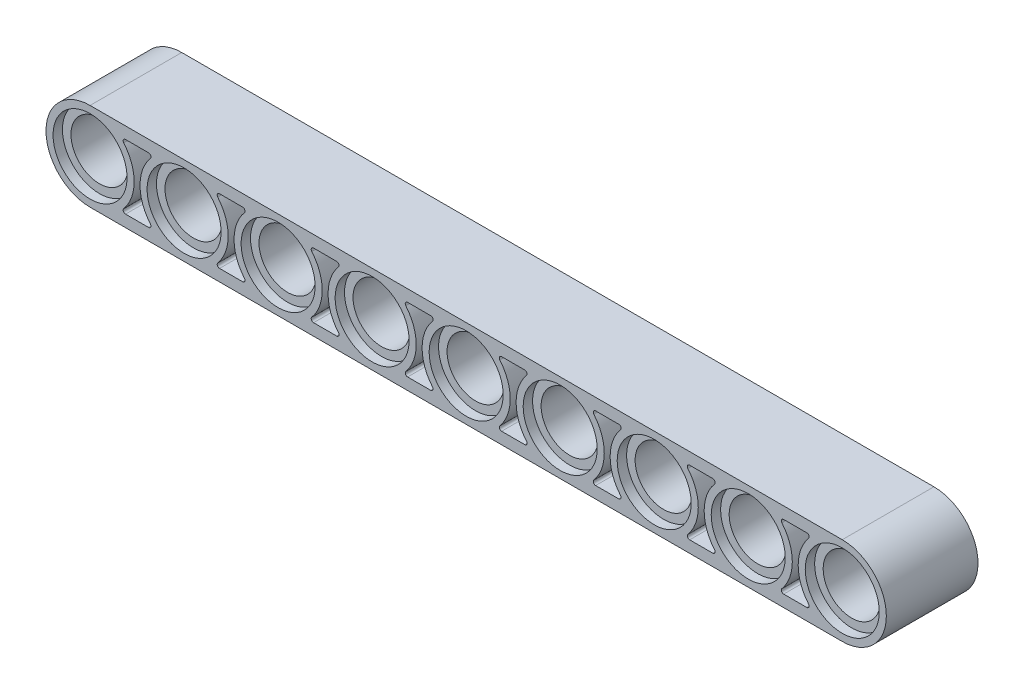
from build123d import *

# Parameters (mm, degrees)
BODY_DEPTH                   = 3.9
CUT_OUT_DEPTH                = 3.4
HOLE_PATTERN_COUNT           = 9
HOLE_PATTERN_PITCH           = 8
CUT_OUT_PATTERN_COUNT        = 8
CUT_OUT_PATTERN_PITCH        = 8
CUT_OUT_PATTERN_COPY_1_DEPTH = 3.4
CUT_OUT_PATTERN_COPY_2_DEPTH = 3.4
CUT_OUT_PATTERN_COPY_3_DEPTH = 3.4
CUT_OUT_PATTERN_COPY_4_DEPTH = 3.4
CUT_OUT_PATTERN_COPY_5_DEPTH = 3.4
CUT_OUT_PATTERN_COPY_6_DEPTH = 3.4
CUT_OUT_PATTERN_COPY_7_DEPTH = 3.4


with BuildPart() as part:
    # Sketch1 → Body (new, symmetric)
    with BuildSketch(Plane.XY):
        with BuildLine():
            Line((0, 3.75), (64, 3.75))
            ThreePointArc((64, 3.75), (67.75, 0), (64, -3.75))
            Line((64, -3.75), (0, -3.75))
            ThreePointArc((0, -3.75), (-3.75, 0), (0, 3.75))
        make_face()
    extrude(amount=BODY_DEPTH, both=True)

    # Sketch2 → Hole (revolve, cut)
    with BuildSketch(Plane(origin=(0, 0, 0), x_dir=(1, 0, 0), z_dir=(0, 1, 0)), mode=Mode.PRIVATE) as hole_sk:
        Polygon((0, -3.9), (0, 3.9), (3.15, 3.9), (3.15, 3.1), (2.425, 3.1), (2.425, -3.1), (3.15, -3.1), (3.15, -3.9), align=None)
    hole = revolve(hole_sk.sketch.rotate(Axis((0, 0, -4.29), (0, 0, 1)), 180), axis=Axis((0, 0, -4.29), (0, 0, 1)), mode=Mode.SUBTRACT)

    # Sketch3 → Cut Out (cut)
    with BuildSketch(Plane.XY.offset(3.9)):
        with BuildLine():
            Line((3.016620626, 2.75), (4.983379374, 2.75))
            ThreePointArc((4.983379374, 2.75), (5.164794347, 2.634193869), (5.136119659, 2.420886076))
            ThreePointArc((5.136119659, 2.420886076), (4.25, 0), (5.136119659, -2.420886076))
            ThreePointArc((5.136119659, -2.420886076), (5.164794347, -2.634193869), (4.983379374, -2.75))
            Line((4.983379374, -2.75), (3.016620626, -2.75))
            ThreePointArc((3.016620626, -2.75), (2.835205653, -2.634193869), (2.863880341, -2.420886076))
            ThreePointArc((2.863880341, -2.420886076), (3.75, 0), (2.863880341, 2.420886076))
            ThreePointArc((2.863880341, 2.420886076), (2.835205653, 2.634193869), (3.016620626, 2.75))
        make_face()
    cut_out = extrude(amount=-CUT_OUT_DEPTH, mode=Mode.SUBTRACT)

    # Mirror1: Cut Out across plane
    add(cut_out.mirror(Plane.XY), mode=Mode.SUBTRACT)

    # HOLE Pattern: Hole ×9
    with Locations(*[(i * HOLE_PATTERN_PITCH, 0, 0) for i in range(1, HOLE_PATTERN_COUNT)]):
        add(hole, mode=Mode.SUBTRACT)

    # CUT OUT Pattern: Cut Out ×8
    with Locations(*[(i * CUT_OUT_PATTERN_PITCH, 0, 0) for i in range(1, CUT_OUT_PATTERN_COUNT)]):
        add(cut_out, mode=Mode.SUBTRACT)

    # CUT OUT Pattern copy 1 sketch → CUT OUT Pattern copy 1 (cut)
    with BuildSketch(Plane(origin=(8, 0, -3.9), x_dir=(1, 0, 0), z_dir=(0, 0, -1))):
        with BuildLine():
            Line((3.016620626, -2.75), (4.983379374, -2.75))
            ThreePointArc((4.983379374, -2.75), (5.164794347, -2.634193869), (5.136119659, -2.420886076))
            ThreePointArc((5.136119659, -2.420886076), (4.25, 0), (5.136119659, 2.420886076))
            ThreePointArc((5.136119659, 2.420886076), (5.164794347, 2.634193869), (4.983379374, 2.75))
            Line((4.983379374, 2.75), (3.016620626, 2.75))
            ThreePointArc((3.016620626, 2.75), (2.835205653, 2.634193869), (2.863880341, 2.420886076))
            ThreePointArc((2.863880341, 2.420886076), (3.75, 0), (2.863880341, -2.420886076))
            ThreePointArc((2.863880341, -2.420886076), (2.835205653, -2.634193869), (3.016620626, -2.75))
        make_face()
    extrude(amount=-CUT_OUT_PATTERN_COPY_1_DEPTH, mode=Mode.SUBTRACT)

    # CUT OUT Pattern copy 2 sketch → CUT OUT Pattern copy 2 (cut)
    with BuildSketch(Plane(origin=(16, 0, -3.9), x_dir=(1, 0, 0), z_dir=(0, 0, -1))):
        with BuildLine():
            Line((3.016620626, -2.75), (4.983379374, -2.75))
            ThreePointArc((4.983379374, -2.75), (5.164794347, -2.634193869), (5.136119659, -2.420886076))
            ThreePointArc((5.136119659, -2.420886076), (4.25, 0), (5.136119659, 2.420886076))
            ThreePointArc((5.136119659, 2.420886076), (5.164794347, 2.634193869), (4.983379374, 2.75))
            Line((4.983379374, 2.75), (3.016620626, 2.75))
            ThreePointArc((3.016620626, 2.75), (2.835205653, 2.634193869), (2.863880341, 2.420886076))
            ThreePointArc((2.863880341, 2.420886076), (3.75, 0), (2.863880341, -2.420886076))
            ThreePointArc((2.863880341, -2.420886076), (2.835205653, -2.634193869), (3.016620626, -2.75))
        make_face()
    extrude(amount=-CUT_OUT_PATTERN_COPY_2_DEPTH, mode=Mode.SUBTRACT)

    # CUT OUT Pattern copy 3 sketch → CUT OUT Pattern copy 3 (cut)
    with BuildSketch(Plane(origin=(24, 0, -3.9), x_dir=(1, 0, 0), z_dir=(0, 0, -1))):
        with BuildLine():
            Line((3.016620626, -2.75), (4.983379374, -2.75))
            ThreePointArc((4.983379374, -2.75), (5.164794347, -2.634193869), (5.136119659, -2.420886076))
            ThreePointArc((5.136119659, -2.420886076), (4.25, 0), (5.136119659, 2.420886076))
            ThreePointArc((5.136119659, 2.420886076), (5.164794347, 2.634193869), (4.983379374, 2.75))
            Line((4.983379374, 2.75), (3.016620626, 2.75))
            ThreePointArc((3.016620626, 2.75), (2.835205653, 2.634193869), (2.863880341, 2.420886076))
            ThreePointArc((2.863880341, 2.420886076), (3.75, 0), (2.863880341, -2.420886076))
            ThreePointArc((2.863880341, -2.420886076), (2.835205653, -2.634193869), (3.016620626, -2.75))
        make_face()
    extrude(amount=-CUT_OUT_PATTERN_COPY_3_DEPTH, mode=Mode.SUBTRACT)

    # CUT OUT Pattern copy 4 sketch → CUT OUT Pattern copy 4 (cut)
    with BuildSketch(Plane(origin=(32, 0, -3.9), x_dir=(1, 0, 0), z_dir=(0, 0, -1))):
        with BuildLine():
            Line((3.016620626, -2.75), (4.983379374, -2.75))
            ThreePointArc((4.983379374, -2.75), (5.164794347, -2.634193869), (5.136119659, -2.420886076))
            ThreePointArc((5.136119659, -2.420886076), (4.25, 0), (5.136119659, 2.420886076))
            ThreePointArc((5.136119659, 2.420886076), (5.164794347, 2.634193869), (4.983379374, 2.75))
            Line((4.983379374, 2.75), (3.016620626, 2.75))
            ThreePointArc((3.016620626, 2.75), (2.835205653, 2.634193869), (2.863880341, 2.420886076))
            ThreePointArc((2.863880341, 2.420886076), (3.75, 0), (2.863880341, -2.420886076))
            ThreePointArc((2.863880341, -2.420886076), (2.835205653, -2.634193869), (3.016620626, -2.75))
        make_face()
    extrude(amount=-CUT_OUT_PATTERN_COPY_4_DEPTH, mode=Mode.SUBTRACT)

    # CUT OUT Pattern copy 5 sketch → CUT OUT Pattern copy 5 (cut)
    with BuildSketch(Plane(origin=(40, 0, -3.9), x_dir=(1, 0, 0), z_dir=(0, 0, -1))):
        with BuildLine():
            Line((3.016620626, -2.75), (4.983379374, -2.75))
            ThreePointArc((4.983379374, -2.75), (5.164794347, -2.634193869), (5.136119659, -2.420886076))
            ThreePointArc((5.136119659, -2.420886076), (4.25, 0), (5.136119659, 2.420886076))
            ThreePointArc((5.136119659, 2.420886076), (5.164794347, 2.634193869), (4.983379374, 2.75))
            Line((4.983379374, 2.75), (3.016620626, 2.75))
            ThreePointArc((3.016620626, 2.75), (2.835205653, 2.634193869), (2.863880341, 2.420886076))
            ThreePointArc((2.863880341, 2.420886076), (3.75, 0), (2.863880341, -2.420886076))
            ThreePointArc((2.863880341, -2.420886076), (2.835205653, -2.634193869), (3.016620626, -2.75))
        make_face()
    extrude(amount=-CUT_OUT_PATTERN_COPY_5_DEPTH, mode=Mode.SUBTRACT)

    # CUT OUT Pattern copy 6 sketch → CUT OUT Pattern copy 6 (cut)
    with BuildSketch(Plane(origin=(48, 0, -3.9), x_dir=(1, 0, 0), z_dir=(0, 0, -1))):
        with BuildLine():
            Line((3.016620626, -2.75), (4.983379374, -2.75))
            ThreePointArc((4.983379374, -2.75), (5.164794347, -2.634193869), (5.136119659, -2.420886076))
            ThreePointArc((5.136119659, -2.420886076), (4.25, 0), (5.136119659, 2.420886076))
            ThreePointArc((5.136119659, 2.420886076), (5.164794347, 2.634193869), (4.983379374, 2.75))
            Line((4.983379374, 2.75), (3.016620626, 2.75))
            ThreePointArc((3.016620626, 2.75), (2.835205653, 2.634193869), (2.863880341, 2.420886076))
            ThreePointArc((2.863880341, 2.420886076), (3.75, 0), (2.863880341, -2.420886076))
            ThreePointArc((2.863880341, -2.420886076), (2.835205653, -2.634193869), (3.016620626, -2.75))
        make_face()
    extrude(amount=-CUT_OUT_PATTERN_COPY_6_DEPTH, mode=Mode.SUBTRACT)

    # CUT OUT Pattern copy 7 sketch → CUT OUT Pattern copy 7 (cut)
    with BuildSketch(Plane(origin=(56, 0, -3.9), x_dir=(1, 0, 0), z_dir=(0, 0, -1))):
        with BuildLine():
            Line((3.016620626, -2.75), (4.983379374, -2.75))
            ThreePointArc((4.983379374, -2.75), (5.164794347, -2.634193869), (5.136119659, -2.420886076))
            ThreePointArc((5.136119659, -2.420886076), (4.25, 0), (5.136119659, 2.420886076))
            ThreePointArc((5.136119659, 2.420886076), (5.164794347, 2.634193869), (4.983379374, 2.75))
            Line((4.983379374, 2.75), (3.016620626, 2.75))
            ThreePointArc((3.016620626, 2.75), (2.835205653, 2.634193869), (2.863880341, 2.420886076))
            ThreePointArc((2.863880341, 2.420886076), (3.75, 0), (2.863880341, -2.420886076))
            ThreePointArc((2.863880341, -2.420886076), (2.835205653, -2.634193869), (3.016620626, -2.75))
        make_face()
    extrude(amount=-CUT_OUT_PATTERN_COPY_7_DEPTH, mode=Mode.SUBTRACT)


solid = part.part
